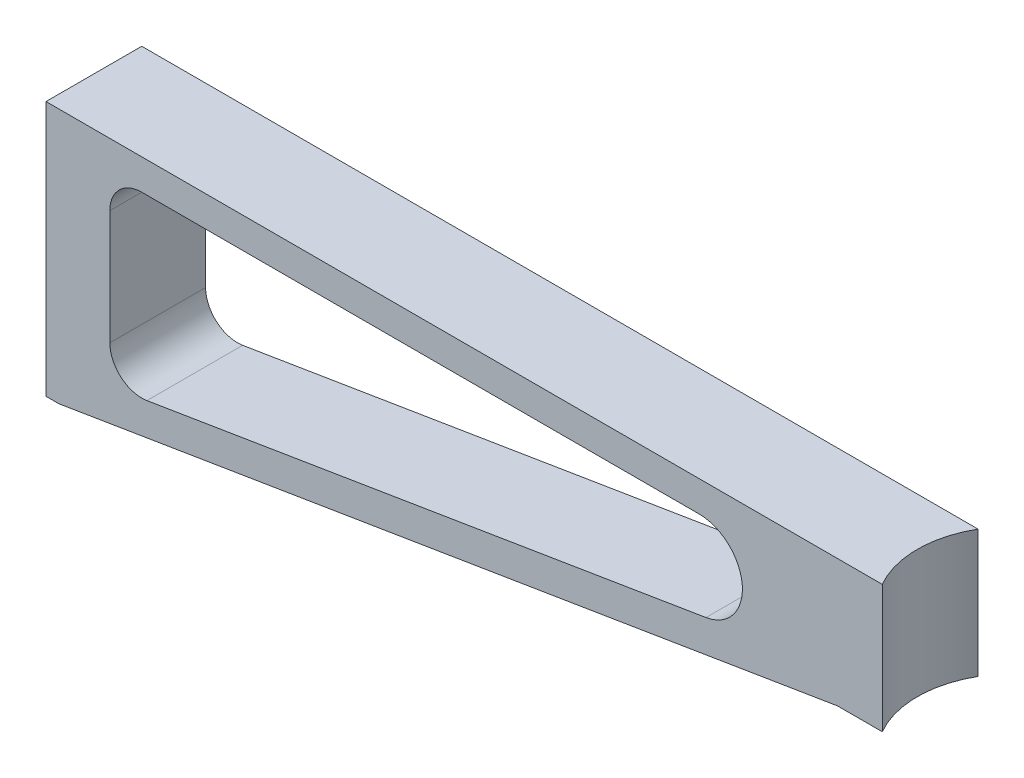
from build123d import *

# Parameters (mm, degrees)
BOSS_EXTRUDE1_DEPTH = 4.7625
SKETCH2_R           = 9.525
CUT_EXTRUDE1_DEPTH  = 96.021655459


with BuildPart() as part:
    # Sketch1 → Boss-Extrude1 (new, symmetric)
    with BuildSketch(Plane.XY):
        Polygon((-91.44, 0), (-91.44, -25.4), (-90.17, -25.4), (-12.7, -12.7), (0, -12.7), (0, 0), align=None)
        with BuildLine():
            Line((-85.09, -6.223), (-85.09, -17.611960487))
            ThreePointArc((-85.09, -17.611960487), (-83.970459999, -20.031817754), (-81.401364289, -20.745138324))
            Line((-81.401364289, -20.745138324), (-25.781463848, -11.627121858))
            ThreePointArc((-25.781463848, -11.627121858), (-22.176251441, -7.015571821), (-26.480008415, -3.048))
            Line((-26.480008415, -3.048), (-81.915, -3.048))
            ThreePointArc((-81.915, -3.048), (-84.16006403, -3.97793597), (-85.09, -6.223))
        make_face(mode=Mode.SUBTRACT)
    extrude(amount=BOSS_EXTRUDE1_DEPTH, both=True)

    # Sketch2 → Cut-Extrude1 (cut, through all)
    with BuildSketch(Plane(origin=(0, 0, 0), x_dir=(1, 0, 0), z_dir=(0, 1, 0))):
        Circle(SKETCH2_R)
    extrude(amount=-CUT_EXTRUDE1_DEPTH, mode=Mode.SUBTRACT)


solid = part.part
